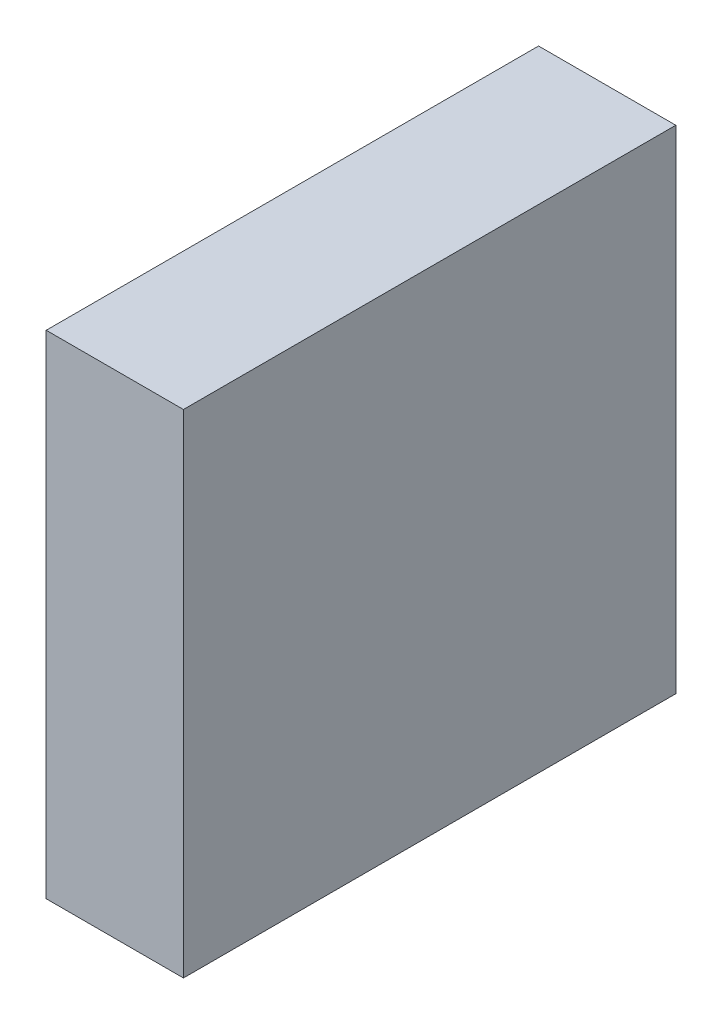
ISO-10303-21;
HEADER;
FILE_DESCRIPTION(('STEP AP214'),'2;1');
FILE_NAME('part.step','',(''),(''),'','','');
FILE_SCHEMA(('AUTOMOTIVE_DESIGN { 1 0 10303 214 1 1 1 1 }'));
ENDSEC;
DATA;
#1=APPLICATION_CONTEXT('core data for automotive mechanical design processes');
#2=APPLICATION_PROTOCOL_DEFINITION('international standard','automotive_design',2000,#1);
#3=PRODUCT_CONTEXT('',#1,'mechanical');
#4=PRODUCT('Part','Part','',(#3));
#5=PRODUCT_RELATED_PRODUCT_CATEGORY('part','',(#4));
#6=PRODUCT_DEFINITION_FORMATION('','',#4);
#7=PRODUCT_DEFINITION_CONTEXT('part definition',#1,'design');
#8=PRODUCT_DEFINITION('design','',#6,#7);
#9=PRODUCT_DEFINITION_SHAPE('','',#8);
#10=(LENGTH_UNIT() NAMED_UNIT(*) SI_UNIT(.MILLI.,.METRE.));
#11=(NAMED_UNIT(*) PLANE_ANGLE_UNIT() SI_UNIT($,.RADIAN.));
#12=(NAMED_UNIT(*) SI_UNIT($,.STERADIAN.) SOLID_ANGLE_UNIT());
#13=UNCERTAINTY_MEASURE_WITH_UNIT(LENGTH_MEASURE(1.E-05),#10,'distance_accuracy_value','');
#14=(GEOMETRIC_REPRESENTATION_CONTEXT(3) GLOBAL_UNCERTAINTY_ASSIGNED_CONTEXT((#13)) GLOBAL_UNIT_ASSIGNED_CONTEXT((#10,
#11,#12)) REPRESENTATION_CONTEXT('',''));
#15=CARTESIAN_POINT('',(0.,0.,0.));
#16=DIRECTION('',(0.,0.,1.));
#17=DIRECTION('',(1.,0.,0.));
#18=AXIS2_PLACEMENT_3D('',#15,#16,#17);
#19=CARTESIAN_POINT('',(0.,0.,0.4499991));
#20=DIRECTION('',(0.,0.,-1.));
#21=DIRECTION('',(0.,-1.,0.));
#22=AXIS2_PLACEMENT_3D('',#19,#20,#21);
#23=PLANE('',#22);
#24=DIRECTION('',(0.,1.,0.));
#25=VECTOR('',#24,1.);
#26=CARTESIAN_POINT('',(-0.06271259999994,-0.22500082,0.4499991));
#27=LINE('',#26,#25);
#28=CARTESIAN_POINT('',(-0.06271259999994,-0.22500082,0.4499991));
#29=VERTEX_POINT('',#28);
#30=CARTESIAN_POINT('',(-0.06271259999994,0.22500082,0.4499991));
#31=VERTEX_POINT('',#30);
#32=EDGE_CURVE('E25',#29,#31,#27,.T.);
#33=ORIENTED_EDGE('',*,*,#32,.F.);
#34=DIRECTION('',(-1.,0.,0.));
#35=VECTOR('',#34,1.);
#36=CARTESIAN_POINT('',(0.0627126,-0.22500082,0.4499991));
#37=LINE('',#36,#35);
#38=CARTESIAN_POINT('',(0.0627126,-0.22500082,0.4499991));
#39=VERTEX_POINT('',#38);
#40=EDGE_CURVE('E109',#39,#29,#37,.T.);
#41=ORIENTED_EDGE('',*,*,#40,.F.);
#42=DIRECTION('',(0.,-1.,0.));
#43=VECTOR('',#42,1.);
#44=CARTESIAN_POINT('',(0.0627126,0.22500082,0.4499991));
#45=LINE('',#44,#43);
#46=CARTESIAN_POINT('',(0.0627126,0.22500082,0.4499991));
#47=VERTEX_POINT('',#46);
#48=EDGE_CURVE('E83',#47,#39,#45,.T.);
#49=ORIENTED_EDGE('',*,*,#48,.F.);
#50=DIRECTION('',(1.,0.,0.));
#51=VECTOR('',#50,1.);
#52=CARTESIAN_POINT('',(-0.06271259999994,0.22500082,0.4499991));
#53=LINE('',#52,#51);
#54=EDGE_CURVE('E87',#31,#47,#53,.T.);
#55=ORIENTED_EDGE('',*,*,#54,.F.);
#56=EDGE_LOOP('',(#33,#41,#49,#55));
#57=FACE_BOUND('',#56,.T.);
#58=ADVANCED_FACE('F17',(#57),#23,.F.);
#59=CARTESIAN_POINT('',(0.,0.,0.));
#60=DIRECTION('',(0.,0.,-1.));
#61=DIRECTION('',(0.,-1.,0.));
#62=AXIS2_PLACEMENT_3D('',#59,#60,#61);
#63=PLANE('',#62);
#64=DIRECTION('',(1.,0.,0.));
#65=VECTOR('',#64,1.);
#66=CARTESIAN_POINT('',(-0.06271259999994,0.22500082,0.));
#67=LINE('',#66,#65);
#68=CARTESIAN_POINT('',(-0.06271259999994,0.22500082,0.));
#69=VERTEX_POINT('',#68);
#70=CARTESIAN_POINT('',(0.0627126,0.22500082,0.));
#71=VERTEX_POINT('',#70);
#72=EDGE_CURVE('E71',#69,#71,#67,.T.);
#73=ORIENTED_EDGE('',*,*,#72,.T.);
#74=DIRECTION('',(0.,-1.,0.));
#75=VECTOR('',#74,1.);
#76=CARTESIAN_POINT('',(0.0627126,0.22500082,0.));
#77=LINE('',#76,#75);
#78=CARTESIAN_POINT('',(0.0627126,-0.22500082,0.));
#79=VERTEX_POINT('',#78);
#80=EDGE_CURVE('E103',#71,#79,#77,.T.);
#81=ORIENTED_EDGE('',*,*,#80,.T.);
#82=DIRECTION('',(-1.,0.,0.));
#83=VECTOR('',#82,1.);
#84=CARTESIAN_POINT('',(0.0627126,-0.22500082,0.));
#85=LINE('',#84,#83);
#86=CARTESIAN_POINT('',(-0.06271259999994,-0.22500082,0.));
#87=VERTEX_POINT('',#86);
#88=EDGE_CURVE('E73',#79,#87,#85,.T.);
#89=ORIENTED_EDGE('',*,*,#88,.T.);
#90=DIRECTION('',(0.,1.,0.));
#91=VECTOR('',#90,1.);
#92=CARTESIAN_POINT('',(-0.06271259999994,-0.22500082,0.));
#93=LINE('',#92,#91);
#94=EDGE_CURVE('E11',#87,#69,#93,.T.);
#95=ORIENTED_EDGE('',*,*,#94,.T.);
#96=EDGE_LOOP('',(#73,#81,#89,#95));
#97=FACE_BOUND('',#96,.T.);
#98=ADVANCED_FACE('F69',(#97),#63,.T.);
#99=CARTESIAN_POINT('',(-0.06271259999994,-0.22500082,0.));
#100=DIRECTION('',(-1.,0.,0.));
#101=DIRECTION('',(0.,0.,1.));
#102=AXIS2_PLACEMENT_3D('',#99,#100,#101);
#103=PLANE('',#102);
#104=DIRECTION('',(0.,0.,1.));
#105=VECTOR('',#104,1.);
#106=CARTESIAN_POINT('',(-0.06271259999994,-0.22500082,0.));
#107=LINE('',#106,#105);
#108=EDGE_CURVE('E113',#87,#29,#107,.T.);
#109=ORIENTED_EDGE('',*,*,#108,.T.);
#110=ORIENTED_EDGE('',*,*,#32,.T.);
#111=DIRECTION('',(0.,0.,1.));
#112=VECTOR('',#111,1.);
#113=CARTESIAN_POINT('',(-0.06271259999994,0.22500082,0.));
#114=LINE('',#113,#112);
#115=EDGE_CURVE('E79',#69,#31,#114,.T.);
#116=ORIENTED_EDGE('',*,*,#115,.F.);
#117=ORIENTED_EDGE('',*,*,#94,.F.);
#118=EDGE_LOOP('',(#109,#110,#116,#117));
#119=FACE_BOUND('',#118,.T.);
#120=ADVANCED_FACE('F85',(#119),#103,.T.);
#121=CARTESIAN_POINT('',(0.0627126,-0.22500082,0.));
#122=DIRECTION('',(0.,-1.,0.));
#123=DIRECTION('',(0.,0.,-1.));
#124=AXIS2_PLACEMENT_3D('',#121,#122,#123);
#125=PLANE('',#124);
#126=DIRECTION('',(0.,0.,1.));
#127=VECTOR('',#126,1.);
#128=CARTESIAN_POINT('',(0.0627126,-0.22500082,0.));
#129=LINE('',#128,#127);
#130=EDGE_CURVE('E99',#79,#39,#129,.T.);
#131=ORIENTED_EDGE('',*,*,#130,.T.);
#132=ORIENTED_EDGE('',*,*,#40,.T.);
#133=ORIENTED_EDGE('',*,*,#108,.F.);
#134=ORIENTED_EDGE('',*,*,#88,.F.);
#135=EDGE_LOOP('',(#131,#132,#133,#134));
#136=FACE_BOUND('',#135,.T.);
#137=ADVANCED_FACE('F169',(#136),#125,.T.);
#138=CARTESIAN_POINT('',(0.0627126,0.22500082,0.));
#139=DIRECTION('',(1.,0.,0.));
#140=DIRECTION('',(0.,1.,0.));
#141=AXIS2_PLACEMENT_3D('',#138,#139,#140);
#142=PLANE('',#141);
#143=DIRECTION('',(0.,0.,1.));
#144=VECTOR('',#143,1.);
#145=CARTESIAN_POINT('',(0.0627126,0.22500082,0.));
#146=LINE('',#145,#144);
#147=EDGE_CURVE('E81',#71,#47,#146,.T.);
#148=ORIENTED_EDGE('',*,*,#147,.T.);
#149=ORIENTED_EDGE('',*,*,#48,.T.);
#150=ORIENTED_EDGE('',*,*,#130,.F.);
#151=ORIENTED_EDGE('',*,*,#80,.F.);
#152=EDGE_LOOP('',(#148,#149,#150,#151));
#153=FACE_BOUND('',#152,.T.);
#154=ADVANCED_FACE('F159',(#153),#142,.T.);
#155=CARTESIAN_POINT('',(-0.06271259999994,0.22500082,0.));
#156=DIRECTION('',(0.,1.,0.));
#157=DIRECTION('',(1.,0.,0.));
#158=AXIS2_PLACEMENT_3D('',#155,#156,#157);
#159=PLANE('',#158);
#160=ORIENTED_EDGE('',*,*,#115,.T.);
#161=ORIENTED_EDGE('',*,*,#54,.T.);
#162=ORIENTED_EDGE('',*,*,#147,.F.);
#163=ORIENTED_EDGE('',*,*,#72,.F.);
#164=EDGE_LOOP('',(#160,#161,#162,#163));
#165=FACE_BOUND('',#164,.T.);
#166=ADVANCED_FACE('F77',(#165),#159,.T.);
#167=CLOSED_SHELL('',(#58,#98,#120,#137,#154,#166));
#168=MANIFOLD_SOLID_BREP('B1',#167);
#169=ADVANCED_BREP_SHAPE_REPRESENTATION('',(#18,#168),#14);
#170=SHAPE_DEFINITION_REPRESENTATION(#9,#169);
ENDSEC;
END-ISO-10303-21;
